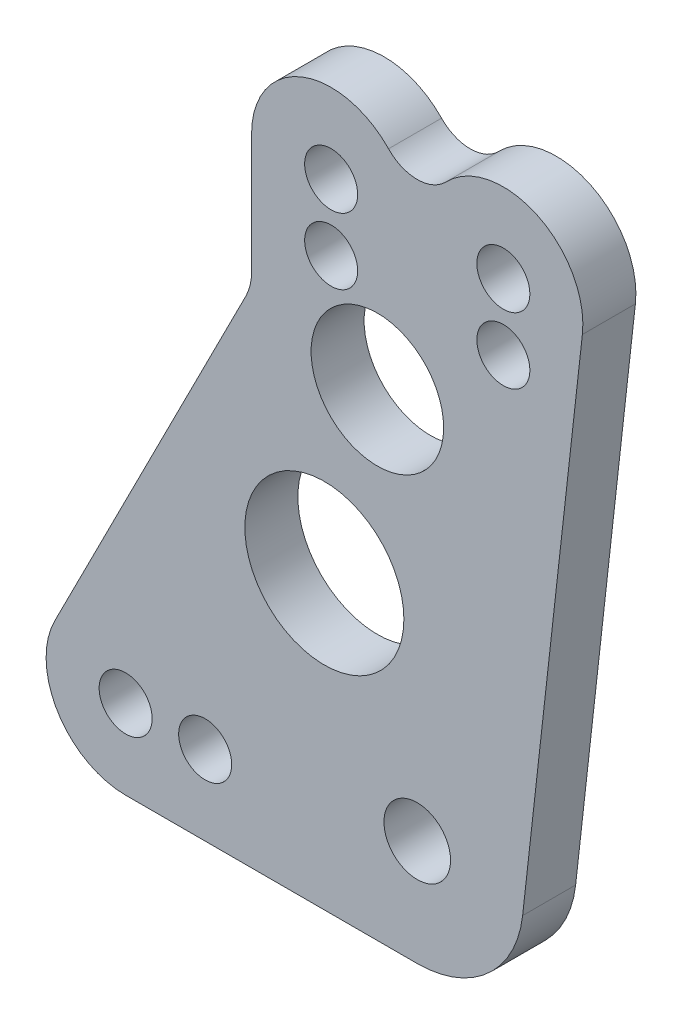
ISO-10303-21;
HEADER;
FILE_DESCRIPTION(('STEP AP214'),'2;1');
FILE_NAME('part.step','',(''),(''),'','','');
FILE_SCHEMA(('AUTOMOTIVE_DESIGN { 1 0 10303 214 1 1 1 1 }'));
ENDSEC;
DATA;
#1=APPLICATION_CONTEXT('core data for automotive mechanical design processes');
#2=APPLICATION_PROTOCOL_DEFINITION('international standard','automotive_design',2000,#1);
#3=PRODUCT_CONTEXT('',#1,'mechanical');
#4=PRODUCT('Part','Part','',(#3));
#5=PRODUCT_RELATED_PRODUCT_CATEGORY('part','',(#4));
#6=PRODUCT_DEFINITION_FORMATION('','',#4);
#7=PRODUCT_DEFINITION_CONTEXT('part definition',#1,'design');
#8=PRODUCT_DEFINITION('design','',#6,#7);
#9=PRODUCT_DEFINITION_SHAPE('','',#8);
#10=(LENGTH_UNIT() NAMED_UNIT(*) SI_UNIT(.MILLI.,.METRE.));
#11=(NAMED_UNIT(*) PLANE_ANGLE_UNIT() SI_UNIT($,.RADIAN.));
#12=(NAMED_UNIT(*) SI_UNIT($,.STERADIAN.) SOLID_ANGLE_UNIT());
#13=UNCERTAINTY_MEASURE_WITH_UNIT(LENGTH_MEASURE(1.E-05),#10,'distance_accuracy_value','');
#14=(GEOMETRIC_REPRESENTATION_CONTEXT(3) GLOBAL_UNCERTAINTY_ASSIGNED_CONTEXT((#13)) GLOBAL_UNIT_ASSIGNED_CONTEXT((#10,
#11,#12)) REPRESENTATION_CONTEXT('',''));
#15=CARTESIAN_POINT('',(0.,0.,0.));
#16=DIRECTION('',(0.,0.,1.));
#17=DIRECTION('',(1.,0.,0.));
#18=AXIS2_PLACEMENT_3D('',#15,#16,#17);
#19=CARTESIAN_POINT('',(-34.925,-3.175,6.35));
#20=DIRECTION('',(0.,0.,1.));
#21=DIRECTION('',(1.,0.,0.));
#22=AXIS2_PLACEMENT_3D('',#19,#20,#21);
#23=PLANE('',#22);
#24=CARTESIAN_POINT('',(10.3124,55.5752,6.35));
#25=DIRECTION('',(0.,0.,1.));
#26=DIRECTION('',(1.,0.,0.));
#27=AXIS2_PLACEMENT_3D('',#24,#25,#26);
#28=CIRCLE('',#27,3.175);
#29=CARTESIAN_POINT('',(7.1374,55.5752,6.35));
#30=VERTEX_POINT('',#29);
#31=EDGE_CURVE('E231',#30,#30,#28,.F.);
#32=ORIENTED_EDGE('',*,*,#31,.T.);
#33=EDGE_LOOP('',(#32));
#34=FACE_BOUND('',#33,.T.);
#35=CARTESIAN_POINT('',(-11.1252,22.225,6.35));
#36=DIRECTION('',(0.,0.,1.));
#37=DIRECTION('',(1.,0.,0.));
#38=AXIS2_PLACEMENT_3D('',#35,#36,#37);
#39=CIRCLE('',#38,9.525);
#40=CARTESIAN_POINT('',(-1.6002,22.225,6.35));
#41=VERTEX_POINT('',#40);
#42=EDGE_CURVE('E219',#41,#41,#39,.T.);
#43=ORIENTED_EDGE('',*,*,#42,.F.);
#44=EDGE_LOOP('',(#43));
#45=FACE_BOUND('',#44,.T.);
#46=CARTESIAN_POINT('',(0.,0.,6.35));
#47=DIRECTION('',(0.,0.,1.));
#48=DIRECTION('',(1.,0.,0.));
#49=AXIS2_PLACEMENT_3D('',#46,#47,#48);
#50=CIRCLE('',#49,3.9878);
#51=CARTESIAN_POINT('',(3.9878,0.,6.35));
#52=VERTEX_POINT('',#51);
#53=EDGE_CURVE('E207',#52,#52,#50,.T.);
#54=ORIENTED_EDGE('',*,*,#53,.F.);
#55=EDGE_LOOP('',(#54));
#56=FACE_BOUND('',#55,.T.);
#57=CARTESIAN_POINT('',(10.3124,63.5,6.35));
#58=DIRECTION('',(0.,0.,1.));
#59=DIRECTION('',(1.,0.,0.));
#60=AXIS2_PLACEMENT_3D('',#57,#58,#59);
#61=CIRCLE('',#60,3.175);
#62=CARTESIAN_POINT('',(13.4874,63.5,6.35));
#63=VERTEX_POINT('',#62);
#64=EDGE_CURVE('E195',#63,#63,#61,.T.);
#65=ORIENTED_EDGE('',*,*,#64,.F.);
#66=EDGE_LOOP('',(#65));
#67=FACE_BOUND('',#66,.T.);
#68=CARTESIAN_POINT('',(-34.925,-3.175,6.35));
#69=DIRECTION('',(0.,0.,1.));
#70=DIRECTION('',(1.,0.,0.));
#71=AXIS2_PLACEMENT_3D('',#68,#69,#70);
#72=CIRCLE('',#71,9.525);
#73=CARTESIAN_POINT('',(-43.4196689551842,1.13385417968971,6.35));
#74=VERTEX_POINT('',#73);
#75=CARTESIAN_POINT('',(-34.925,-12.7,6.35));
#76=VERTEX_POINT('',#75);
#77=EDGE_CURVE('E125',#74,#76,#72,.T.);
#78=ORIENTED_EDGE('',*,*,#77,.T.);
#79=DIRECTION('',(1.,0.,0.));
#80=VECTOR('',#79,1.);
#81=CARTESIAN_POINT('',(-34.925,-12.7,6.35));
#82=LINE('',#81,#80);
#83=CARTESIAN_POINT('',(0.,-12.7,6.35));
#84=VERTEX_POINT('',#83);
#85=EDGE_CURVE('E114',#76,#84,#82,.T.);
#86=ORIENTED_EDGE('',*,*,#85,.T.);
#87=CARTESIAN_POINT('',(0.,0.,6.35));
#88=DIRECTION('',(0.,0.,1.));
#89=DIRECTION('',(1.,0.,0.));
#90=AXIS2_PLACEMENT_3D('',#87,#88,#89);
#91=CIRCLE('',#90,12.7);
#92=CARTESIAN_POINT('',(12.6209658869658,-1.41464486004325,6.35));
#93=VERTEX_POINT('',#92);
#94=EDGE_CURVE('E124',#84,#93,#91,.T.);
#95=ORIENTED_EDGE('',*,*,#94,.T.);
#96=DIRECTION('',(0.111389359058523,0.993776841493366,0.));
#97=VECTOR('',#96,1.);
#98=CARTESIAN_POINT('',(12.6209658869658,-1.41464486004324,6.35));
#99=LINE('',#98,#97);
#100=CARTESIAN_POINT('',(19.7781244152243,62.4390163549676,6.35));
#101=VERTEX_POINT('',#100);
#102=EDGE_CURVE('E189',#93,#101,#99,.T.);
#103=ORIENTED_EDGE('',*,*,#102,.T.);
#104=CARTESIAN_POINT('',(10.3124,63.5,6.35));
#105=DIRECTION('',(0.,0.,1.));
#106=DIRECTION('',(1.,0.,0.));
#107=AXIS2_PLACEMENT_3D('',#104,#105,#106);
#108=CIRCLE('',#107,9.52500000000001);
#109=CARTESIAN_POINT('',(3.43746666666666,70.0924894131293,6.35));
#110=VERTEX_POINT('',#109);
#111=EDGE_CURVE('E187',#101,#110,#108,.T.);
#112=ORIENTED_EDGE('',*,*,#111,.T.);
#113=CARTESIAN_POINT('',(0.,73.388734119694,6.35));
#114=DIRECTION('',(0.,0.,-1.));
#115=DIRECTION('',(1.,0.,0.));
#116=AXIS2_PLACEMENT_3D('',#113,#114,#115);
#117=CIRCLE('',#116,4.7625);
#118=CARTESIAN_POINT('',(-3.43746666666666,70.0924894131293,6.35));
#119=VERTEX_POINT('',#118);
#120=EDGE_CURVE('E185',#110,#119,#117,.T.);
#121=ORIENTED_EDGE('',*,*,#120,.T.);
#122=CARTESIAN_POINT('',(-10.3124,63.5,6.35));
#123=DIRECTION('',(0.,0.,1.));
#124=DIRECTION('',(1.,0.,0.));
#125=AXIS2_PLACEMENT_3D('',#122,#123,#124);
#126=CIRCLE('',#125,9.525);
#127=CARTESIAN_POINT('',(-19.8374,63.5,6.35));
#128=VERTEX_POINT('',#127);
#129=EDGE_CURVE('E183',#119,#128,#126,.T.);
#130=ORIENTED_EDGE('',*,*,#129,.T.);
#131=DIRECTION('',(0.,-1.,0.));
#132=VECTOR('',#131,1.);
#133=CARTESIAN_POINT('',(-19.8374,63.5,6.35));
#134=LINE('',#133,#132);
#135=CARTESIAN_POINT('',(-19.8374,49.1434088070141,6.35));
#136=VERTEX_POINT('',#135);
#137=EDGE_CURVE('E181',#128,#136,#134,.T.);
#138=ORIENTED_EDGE('',*,*,#137,.T.);
#139=CARTESIAN_POINT('',(-26.1874,49.1434088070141,6.35));
#140=DIRECTION('',(0.,0.,1.));
#141=DIRECTION('',(1.,0.,0.));
#142=AXIS2_PLACEMENT_3D('',#139,#140,#141);
#143=CIRCLE('',#142,6.35);
#144=CARTESIAN_POINT('',(-20.5242873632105,46.2708393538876,6.35));
#145=VERTEX_POINT('',#144);
#146=EDGE_CURVE('E11',#136,#145,#143,.F.);
#147=ORIENTED_EDGE('',*,*,#146,.T.);
#148=DIRECTION('',(-0.452373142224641,-0.891828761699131,0.));
#149=VECTOR('',#148,1.);
#150=CARTESIAN_POINT('',(-19.8374,47.625,6.35));
#151=LINE('',#150,#149);
#152=EDGE_CURVE('E130',#145,#74,#151,.T.);
#153=ORIENTED_EDGE('',*,*,#152,.T.);
#154=EDGE_LOOP('',(#78,#86,#95,#103,#112,#121,#130,#138,#147,#153));
#155=FACE_BOUND('',#154,.T.);
#156=CARTESIAN_POINT('',(-25.4,-3.175,6.35));
#157=DIRECTION('',(0.,0.,1.));
#158=DIRECTION('',(1.,0.,0.));
#159=AXIS2_PLACEMENT_3D('',#156,#157,#158);
#160=CIRCLE('',#159,3.175);
#161=CARTESIAN_POINT('',(-22.225,-3.175,6.35));
#162=VERTEX_POINT('',#161);
#163=EDGE_CURVE('E179',#162,#162,#160,.T.);
#164=ORIENTED_EDGE('',*,*,#163,.F.);
#165=EDGE_LOOP('',(#164));
#166=FACE_BOUND('',#165,.T.);
#167=CARTESIAN_POINT('',(-10.3124,63.5,6.35));
#168=DIRECTION('',(0.,0.,1.));
#169=DIRECTION('',(1.,0.,0.));
#170=AXIS2_PLACEMENT_3D('',#167,#168,#169);
#171=CIRCLE('',#170,3.175);
#172=CARTESIAN_POINT('',(-7.1374,63.5,6.35));
#173=VERTEX_POINT('',#172);
#174=EDGE_CURVE('E201',#173,#173,#171,.T.);
#175=ORIENTED_EDGE('',*,*,#174,.F.);
#176=EDGE_LOOP('',(#175));
#177=FACE_BOUND('',#176,.T.);
#178=CARTESIAN_POINT('',(-34.925,-3.175,6.35));
#179=DIRECTION('',(0.,0.,1.));
#180=DIRECTION('',(1.,0.,0.));
#181=AXIS2_PLACEMENT_3D('',#178,#179,#180);
#182=CIRCLE('',#181,3.17500000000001);
#183=CARTESIAN_POINT('',(-31.75,-3.175,6.35));
#184=VERTEX_POINT('',#183);
#185=EDGE_CURVE('E213',#184,#184,#182,.T.);
#186=ORIENTED_EDGE('',*,*,#185,.F.);
#187=EDGE_LOOP('',(#186));
#188=FACE_BOUND('',#187,.T.);
#189=CARTESIAN_POINT('',(-4.7752,44.45,6.35));
#190=DIRECTION('',(0.,0.,1.));
#191=DIRECTION('',(1.,0.,0.));
#192=AXIS2_PLACEMENT_3D('',#189,#190,#191);
#193=CIRCLE('',#192,7.9375);
#194=CARTESIAN_POINT('',(3.1623,44.45,6.35));
#195=VERTEX_POINT('',#194);
#196=EDGE_CURVE('E225',#195,#195,#193,.T.);
#197=ORIENTED_EDGE('',*,*,#196,.F.);
#198=EDGE_LOOP('',(#197));
#199=FACE_BOUND('',#198,.T.);
#200=CARTESIAN_POINT('',(-10.3124,55.5752,6.35));
#201=DIRECTION('',(0.,0.,1.));
#202=DIRECTION('',(1.,0.,0.));
#203=AXIS2_PLACEMENT_3D('',#200,#201,#202);
#204=CIRCLE('',#203,3.175);
#205=CARTESIAN_POINT('',(-13.4874,55.5752,6.35));
#206=VERTEX_POINT('',#205);
#207=EDGE_CURVE('E239',#206,#206,#204,.F.);
#208=ORIENTED_EDGE('',*,*,#207,.T.);
#209=EDGE_LOOP('',(#208));
#210=FACE_BOUND('',#209,.T.);
#211=ADVANCED_FACE('F37',(#34,#45,#56,#67,#155,#166,#177,#188,#199,#210),#23,.T.);
#212=CARTESIAN_POINT('',(-34.925,-3.175,0.));
#213=DIRECTION('',(0.,0.,1.));
#214=DIRECTION('',(1.,0.,0.));
#215=AXIS2_PLACEMENT_3D('',#212,#213,#214);
#216=PLANE('',#215);
#217=CARTESIAN_POINT('',(10.3124,55.5752,0.));
#218=DIRECTION('',(0.,0.,1.));
#219=DIRECTION('',(1.,0.,0.));
#220=AXIS2_PLACEMENT_3D('',#217,#218,#219);
#221=CIRCLE('',#220,3.175);
#222=CARTESIAN_POINT('',(7.1374,55.5752,0.));
#223=VERTEX_POINT('',#222);
#224=EDGE_CURVE('E236',#223,#223,#221,.T.);
#225=ORIENTED_EDGE('',*,*,#224,.T.);
#226=EDGE_LOOP('',(#225));
#227=FACE_BOUND('',#226,.T.);
#228=CARTESIAN_POINT('',(-11.1252,22.225,0.));
#229=DIRECTION('',(0.,0.,1.));
#230=DIRECTION('',(1.,0.,0.));
#231=AXIS2_PLACEMENT_3D('',#228,#229,#230);
#232=CIRCLE('',#231,9.525);
#233=CARTESIAN_POINT('',(-1.6002,22.225,0.));
#234=VERTEX_POINT('',#233);
#235=EDGE_CURVE('E222',#234,#234,#232,.T.);
#236=ORIENTED_EDGE('',*,*,#235,.T.);
#237=EDGE_LOOP('',(#236));
#238=FACE_BOUND('',#237,.T.);
#239=CARTESIAN_POINT('',(0.,0.,0.));
#240=DIRECTION('',(0.,0.,1.));
#241=DIRECTION('',(1.,0.,0.));
#242=AXIS2_PLACEMENT_3D('',#239,#240,#241);
#243=CIRCLE('',#242,3.9878);
#244=CARTESIAN_POINT('',(3.9878,0.,0.));
#245=VERTEX_POINT('',#244);
#246=EDGE_CURVE('E210',#245,#245,#243,.T.);
#247=ORIENTED_EDGE('',*,*,#246,.T.);
#248=EDGE_LOOP('',(#247));
#249=FACE_BOUND('',#248,.T.);
#250=CARTESIAN_POINT('',(10.3124,63.5,0.));
#251=DIRECTION('',(0.,0.,1.));
#252=DIRECTION('',(1.,0.,0.));
#253=AXIS2_PLACEMENT_3D('',#250,#251,#252);
#254=CIRCLE('',#253,3.175);
#255=CARTESIAN_POINT('',(13.4874,63.5,0.));
#256=VERTEX_POINT('',#255);
#257=EDGE_CURVE('E198',#256,#256,#254,.T.);
#258=ORIENTED_EDGE('',*,*,#257,.T.);
#259=EDGE_LOOP('',(#258));
#260=FACE_BOUND('',#259,.T.);
#261=CARTESIAN_POINT('',(-34.925,-3.175,0.));
#262=DIRECTION('',(0.,0.,1.));
#263=DIRECTION('',(1.,0.,0.));
#264=AXIS2_PLACEMENT_3D('',#261,#262,#263);
#265=CIRCLE('',#264,9.525);
#266=CARTESIAN_POINT('',(-43.4196689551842,1.13385417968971,0.));
#267=VERTEX_POINT('',#266);
#268=CARTESIAN_POINT('',(-34.925,-12.7,0.));
#269=VERTEX_POINT('',#268);
#270=EDGE_CURVE('E138',#267,#269,#265,.T.);
#271=ORIENTED_EDGE('',*,*,#270,.F.);
#272=DIRECTION('',(-0.452373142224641,-0.891828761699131,0.));
#273=VECTOR('',#272,1.);
#274=CARTESIAN_POINT('',(-19.8374,47.625,0.));
#275=LINE('',#274,#273);
#276=CARTESIAN_POINT('',(-20.5242873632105,46.2708393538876,0.));
#277=VERTEX_POINT('',#276);
#278=EDGE_CURVE('E134',#277,#267,#275,.T.);
#279=ORIENTED_EDGE('',*,*,#278,.F.);
#280=CARTESIAN_POINT('',(-26.1874,49.1434088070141,0.));
#281=DIRECTION('',(0.,0.,1.));
#282=DIRECTION('',(1.,0.,0.));
#283=AXIS2_PLACEMENT_3D('',#280,#281,#282);
#284=CIRCLE('',#283,6.35);
#285=CARTESIAN_POINT('',(-19.8374,49.1434088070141,0.));
#286=VERTEX_POINT('',#285);
#287=EDGE_CURVE('E45',#277,#286,#284,.T.);
#288=ORIENTED_EDGE('',*,*,#287,.T.);
#289=DIRECTION('',(0.,-1.,0.));
#290=VECTOR('',#289,1.);
#291=CARTESIAN_POINT('',(-19.8374,63.5,0.));
#292=LINE('',#291,#290);
#293=CARTESIAN_POINT('',(-19.8374,63.5,0.));
#294=VERTEX_POINT('',#293);
#295=EDGE_CURVE('E164',#294,#286,#292,.T.);
#296=ORIENTED_EDGE('',*,*,#295,.F.);
#297=CARTESIAN_POINT('',(-10.3124,63.5,0.));
#298=DIRECTION('',(0.,0.,1.));
#299=DIRECTION('',(1.,0.,0.));
#300=AXIS2_PLACEMENT_3D('',#297,#298,#299);
#301=CIRCLE('',#300,9.525);
#302=CARTESIAN_POINT('',(-3.43746666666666,70.0924894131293,0.));
#303=VERTEX_POINT('',#302);
#304=EDGE_CURVE('E166',#303,#294,#301,.T.);
#305=ORIENTED_EDGE('',*,*,#304,.F.);
#306=CARTESIAN_POINT('',(0.,73.388734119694,0.));
#307=DIRECTION('',(0.,0.,-1.));
#308=DIRECTION('',(1.,0.,0.));
#309=AXIS2_PLACEMENT_3D('',#306,#307,#308);
#310=CIRCLE('',#309,4.7625);
#311=CARTESIAN_POINT('',(3.43746666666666,70.0924894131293,0.));
#312=VERTEX_POINT('',#311);
#313=EDGE_CURVE('E168',#312,#303,#310,.T.);
#314=ORIENTED_EDGE('',*,*,#313,.F.);
#315=CARTESIAN_POINT('',(10.3124,63.5,0.));
#316=DIRECTION('',(0.,0.,1.));
#317=DIRECTION('',(1.,0.,0.));
#318=AXIS2_PLACEMENT_3D('',#315,#316,#317);
#319=CIRCLE('',#318,9.52500000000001);
#320=CARTESIAN_POINT('',(19.7781244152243,62.4390163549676,0.));
#321=VERTEX_POINT('',#320);
#322=EDGE_CURVE('E170',#321,#312,#319,.T.);
#323=ORIENTED_EDGE('',*,*,#322,.F.);
#324=DIRECTION('',(0.111389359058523,0.993776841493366,0.));
#325=VECTOR('',#324,1.);
#326=CARTESIAN_POINT('',(12.6209658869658,-1.41464486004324,0.));
#327=LINE('',#326,#325);
#328=CARTESIAN_POINT('',(12.6209658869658,-1.41464486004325,0.));
#329=VERTEX_POINT('',#328);
#330=EDGE_CURVE('E172',#329,#321,#327,.T.);
#331=ORIENTED_EDGE('',*,*,#330,.F.);
#332=CARTESIAN_POINT('',(0.,0.,0.));
#333=DIRECTION('',(0.,0.,1.));
#334=DIRECTION('',(1.,0.,0.));
#335=AXIS2_PLACEMENT_3D('',#332,#333,#334);
#336=CIRCLE('',#335,12.7);
#337=CARTESIAN_POINT('',(0.,-12.7,0.));
#338=VERTEX_POINT('',#337);
#339=EDGE_CURVE('E174',#338,#329,#336,.T.);
#340=ORIENTED_EDGE('',*,*,#339,.F.);
#341=DIRECTION('',(1.,0.,0.));
#342=VECTOR('',#341,1.);
#343=CARTESIAN_POINT('',(-34.925,-12.7,0.));
#344=LINE('',#343,#342);
#345=EDGE_CURVE('E176',#269,#338,#344,.T.);
#346=ORIENTED_EDGE('',*,*,#345,.F.);
#347=EDGE_LOOP('',(#271,#279,#288,#296,#305,#314,#323,#331,#340,#346));
#348=FACE_BOUND('',#347,.T.);
#349=CARTESIAN_POINT('',(-25.4,-3.175,0.));
#350=DIRECTION('',(0.,0.,1.));
#351=DIRECTION('',(1.,0.,0.));
#352=AXIS2_PLACEMENT_3D('',#349,#350,#351);
#353=CIRCLE('',#352,3.175);
#354=CARTESIAN_POINT('',(-22.225,-3.175,0.));
#355=VERTEX_POINT('',#354);
#356=EDGE_CURVE('E192',#355,#355,#353,.T.);
#357=ORIENTED_EDGE('',*,*,#356,.T.);
#358=EDGE_LOOP('',(#357));
#359=FACE_BOUND('',#358,.T.);
#360=CARTESIAN_POINT('',(-10.3124,63.5,0.));
#361=DIRECTION('',(0.,0.,1.));
#362=DIRECTION('',(1.,0.,0.));
#363=AXIS2_PLACEMENT_3D('',#360,#361,#362);
#364=CIRCLE('',#363,3.175);
#365=CARTESIAN_POINT('',(-7.1374,63.5,0.));
#366=VERTEX_POINT('',#365);
#367=EDGE_CURVE('E204',#366,#366,#364,.T.);
#368=ORIENTED_EDGE('',*,*,#367,.T.);
#369=EDGE_LOOP('',(#368));
#370=FACE_BOUND('',#369,.T.);
#371=CARTESIAN_POINT('',(-34.925,-3.175,0.));
#372=DIRECTION('',(0.,0.,1.));
#373=DIRECTION('',(1.,0.,0.));
#374=AXIS2_PLACEMENT_3D('',#371,#372,#373);
#375=CIRCLE('',#374,3.17500000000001);
#376=CARTESIAN_POINT('',(-31.75,-3.175,0.));
#377=VERTEX_POINT('',#376);
#378=EDGE_CURVE('E216',#377,#377,#375,.T.);
#379=ORIENTED_EDGE('',*,*,#378,.T.);
#380=EDGE_LOOP('',(#379));
#381=FACE_BOUND('',#380,.T.);
#382=CARTESIAN_POINT('',(-4.7752,44.45,0.));
#383=DIRECTION('',(0.,0.,1.));
#384=DIRECTION('',(1.,0.,0.));
#385=AXIS2_PLACEMENT_3D('',#382,#383,#384);
#386=CIRCLE('',#385,7.9375);
#387=CARTESIAN_POINT('',(3.1623,44.45,0.));
#388=VERTEX_POINT('',#387);
#389=EDGE_CURVE('E228',#388,#388,#386,.T.);
#390=ORIENTED_EDGE('',*,*,#389,.T.);
#391=EDGE_LOOP('',(#390));
#392=FACE_BOUND('',#391,.T.);
#393=CARTESIAN_POINT('',(-10.3124,55.5752,0.));
#394=DIRECTION('',(0.,0.,1.));
#395=DIRECTION('',(1.,0.,0.));
#396=AXIS2_PLACEMENT_3D('',#393,#394,#395);
#397=CIRCLE('',#396,3.175);
#398=CARTESIAN_POINT('',(-13.4874,55.5752,0.));
#399=VERTEX_POINT('',#398);
#400=EDGE_CURVE('E242',#399,#399,#397,.T.);
#401=ORIENTED_EDGE('',*,*,#400,.T.);
#402=EDGE_LOOP('',(#401));
#403=FACE_BOUND('',#402,.T.);
#404=ADVANCED_FACE('F246',(#227,#238,#249,#260,#348,#359,#370,#381,#392,#403),#216,.F.);
#405=CARTESIAN_POINT('',(-34.925,-3.175,6.35));
#406=DIRECTION('',(0.,0.,-1.));
#407=DIRECTION('',(-1.,0.,0.));
#408=AXIS2_PLACEMENT_3D('',#405,#406,#407);
#409=CYLINDRICAL_SURFACE('',#408,9.525);
#410=ORIENTED_EDGE('',*,*,#270,.T.);
#411=DIRECTION('',(0.,0.,-1.));
#412=VECTOR('',#411,1.);
#413=CARTESIAN_POINT('',(-34.925,-12.7,6.35));
#414=LINE('',#413,#412);
#415=EDGE_CURVE('E118',#76,#269,#414,.T.);
#416=ORIENTED_EDGE('',*,*,#415,.F.);
#417=ORIENTED_EDGE('',*,*,#77,.F.);
#418=DIRECTION('',(0.,0.,-1.));
#419=VECTOR('',#418,1.);
#420=CARTESIAN_POINT('',(-43.4196689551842,1.13385417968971,6.35));
#421=LINE('',#420,#419);
#422=EDGE_CURVE('E161',#74,#267,#421,.T.);
#423=ORIENTED_EDGE('',*,*,#422,.T.);
#424=EDGE_LOOP('',(#410,#416,#417,#423));
#425=FACE_BOUND('',#424,.T.);
#426=ADVANCED_FACE('F136',(#425),#409,.T.);
#427=CARTESIAN_POINT('',(-34.925,-12.7,6.35));
#428=DIRECTION('',(0.,1.,0.));
#429=DIRECTION('',(-1.,0.,0.));
#430=AXIS2_PLACEMENT_3D('',#427,#428,#429);
#431=PLANE('',#430);
#432=ORIENTED_EDGE('',*,*,#345,.T.);
#433=DIRECTION('',(0.,0.,-1.));
#434=VECTOR('',#433,1.);
#435=CARTESIAN_POINT('',(0.,-12.7,6.35));
#436=LINE('',#435,#434);
#437=EDGE_CURVE('E121',#84,#338,#436,.T.);
#438=ORIENTED_EDGE('',*,*,#437,.F.);
#439=ORIENTED_EDGE('',*,*,#85,.F.);
#440=ORIENTED_EDGE('',*,*,#415,.T.);
#441=EDGE_LOOP('',(#432,#438,#439,#440));
#442=FACE_BOUND('',#441,.T.);
#443=ADVANCED_FACE('F116',(#442),#431,.F.);
#444=CARTESIAN_POINT('',(0.,0.,6.35));
#445=DIRECTION('',(0.,0.,-1.));
#446=DIRECTION('',(-1.,0.,0.));
#447=AXIS2_PLACEMENT_3D('',#444,#445,#446);
#448=CYLINDRICAL_SURFACE('',#447,12.7);
#449=ORIENTED_EDGE('',*,*,#339,.T.);
#450=DIRECTION('',(0.,0.,-1.));
#451=VECTOR('',#450,1.);
#452=CARTESIAN_POINT('',(12.6209658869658,-1.41464486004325,6.35));
#453=LINE('',#452,#451);
#454=EDGE_CURVE('E143',#93,#329,#453,.T.);
#455=ORIENTED_EDGE('',*,*,#454,.F.);
#456=ORIENTED_EDGE('',*,*,#94,.F.);
#457=ORIENTED_EDGE('',*,*,#437,.T.);
#458=EDGE_LOOP('',(#449,#455,#456,#457));
#459=FACE_BOUND('',#458,.T.);
#460=ADVANCED_FACE('F297',(#459),#448,.T.);
#461=CARTESIAN_POINT('',(12.6209658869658,-1.41464486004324,6.35));
#462=DIRECTION('',(-0.993776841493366,0.111389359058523,0.));
#463=DIRECTION('',(-0.111389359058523,-0.993776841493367,0.));
#464=AXIS2_PLACEMENT_3D('',#461,#462,#463);
#465=PLANE('',#464);
#466=ORIENTED_EDGE('',*,*,#330,.T.);
#467=DIRECTION('',(0.,0.,-1.));
#468=VECTOR('',#467,1.);
#469=CARTESIAN_POINT('',(19.7781244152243,62.4390163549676,6.35));
#470=LINE('',#469,#468);
#471=EDGE_CURVE('E149',#101,#321,#470,.T.);
#472=ORIENTED_EDGE('',*,*,#471,.F.);
#473=ORIENTED_EDGE('',*,*,#102,.F.);
#474=ORIENTED_EDGE('',*,*,#454,.T.);
#475=EDGE_LOOP('',(#466,#472,#473,#474));
#476=FACE_BOUND('',#475,.T.);
#477=ADVANCED_FACE('F293',(#476),#465,.F.);
#478=CARTESIAN_POINT('',(10.3124,63.5,6.35));
#479=DIRECTION('',(0.,0.,-1.));
#480=DIRECTION('',(-1.,0.,0.));
#481=AXIS2_PLACEMENT_3D('',#478,#479,#480);
#482=CYLINDRICAL_SURFACE('',#481,9.52500000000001);
#483=ORIENTED_EDGE('',*,*,#322,.T.);
#484=DIRECTION('',(0.,0.,-1.));
#485=VECTOR('',#484,1.);
#486=CARTESIAN_POINT('',(3.43746666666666,70.0924894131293,6.35));
#487=LINE('',#486,#485);
#488=EDGE_CURVE('E152',#110,#312,#487,.T.);
#489=ORIENTED_EDGE('',*,*,#488,.F.);
#490=ORIENTED_EDGE('',*,*,#111,.F.);
#491=ORIENTED_EDGE('',*,*,#471,.T.);
#492=EDGE_LOOP('',(#483,#489,#490,#491));
#493=FACE_BOUND('',#492,.T.);
#494=ADVANCED_FACE('F289',(#493),#482,.T.);
#495=CARTESIAN_POINT('',(0.,73.388734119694,6.35));
#496=DIRECTION('',(0.,0.,-1.));
#497=DIRECTION('',(-1.,0.,0.));
#498=AXIS2_PLACEMENT_3D('',#495,#496,#497);
#499=CYLINDRICAL_SURFACE('',#498,4.7625);
#500=ORIENTED_EDGE('',*,*,#313,.T.);
#501=DIRECTION('',(0.,0.,-1.));
#502=VECTOR('',#501,1.);
#503=CARTESIAN_POINT('',(-3.43746666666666,70.0924894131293,6.35));
#504=LINE('',#503,#502);
#505=EDGE_CURVE('E155',#119,#303,#504,.T.);
#506=ORIENTED_EDGE('',*,*,#505,.F.);
#507=ORIENTED_EDGE('',*,*,#120,.F.);
#508=ORIENTED_EDGE('',*,*,#488,.T.);
#509=EDGE_LOOP('',(#500,#506,#507,#508));
#510=FACE_BOUND('',#509,.T.);
#511=ADVANCED_FACE('F285',(#510),#499,.F.);
#512=CARTESIAN_POINT('',(-10.3124,63.5,6.35));
#513=DIRECTION('',(0.,0.,-1.));
#514=DIRECTION('',(-1.,0.,0.));
#515=AXIS2_PLACEMENT_3D('',#512,#513,#514);
#516=CYLINDRICAL_SURFACE('',#515,9.525);
#517=ORIENTED_EDGE('',*,*,#304,.T.);
#518=DIRECTION('',(0.,0.,-1.));
#519=VECTOR('',#518,1.);
#520=CARTESIAN_POINT('',(-19.8374,63.5,6.35));
#521=LINE('',#520,#519);
#522=EDGE_CURVE('E158',#128,#294,#521,.T.);
#523=ORIENTED_EDGE('',*,*,#522,.F.);
#524=ORIENTED_EDGE('',*,*,#129,.F.);
#525=ORIENTED_EDGE('',*,*,#505,.T.);
#526=EDGE_LOOP('',(#517,#523,#524,#525));
#527=FACE_BOUND('',#526,.T.);
#528=ADVANCED_FACE('F282',(#527),#516,.T.);
#529=CARTESIAN_POINT('',(-19.8374,63.5,6.35));
#530=DIRECTION('',(1.,0.,0.));
#531=DIRECTION('',(0.,0.,-1.));
#532=AXIS2_PLACEMENT_3D('',#529,#530,#531);
#533=PLANE('',#532);
#534=ORIENTED_EDGE('',*,*,#295,.T.);
#535=DIRECTION('',(0.,0.,-1.));
#536=VECTOR('',#535,1.);
#537=CARTESIAN_POINT('',(-19.8374,49.1434088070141,6.35));
#538=LINE('',#537,#536);
#539=EDGE_CURVE('E52',#286,#136,#538,.F.);
#540=ORIENTED_EDGE('',*,*,#539,.T.);
#541=ORIENTED_EDGE('',*,*,#137,.F.);
#542=ORIENTED_EDGE('',*,*,#522,.T.);
#543=EDGE_LOOP('',(#534,#540,#541,#542));
#544=FACE_BOUND('',#543,.T.);
#545=ADVANCED_FACE('F278',(#544),#533,.F.);
#546=CARTESIAN_POINT('',(-19.8374,47.625,6.35));
#547=DIRECTION('',(0.89182876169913,-0.452373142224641,0.));
#548=DIRECTION('',(0.452373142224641,0.891828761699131,0.));
#549=AXIS2_PLACEMENT_3D('',#546,#547,#548);
#550=PLANE('',#549);
#551=ORIENTED_EDGE('',*,*,#152,.F.);
#552=DIRECTION('',(0.,0.,-1.));
#553=VECTOR('',#552,1.);
#554=CARTESIAN_POINT('',(-20.5242873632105,46.2708393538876,0.));
#555=LINE('',#554,#553);
#556=EDGE_CURVE('E139',#145,#277,#555,.T.);
#557=ORIENTED_EDGE('',*,*,#556,.T.);
#558=ORIENTED_EDGE('',*,*,#278,.T.);
#559=ORIENTED_EDGE('',*,*,#422,.F.);
#560=EDGE_LOOP('',(#551,#557,#558,#559));
#561=FACE_BOUND('',#560,.T.);
#562=ADVANCED_FACE('F275',(#561),#550,.F.);
#563=CARTESIAN_POINT('',(-25.4,-3.175,6.35));
#564=DIRECTION('',(0.,0.,-1.));
#565=DIRECTION('',(-1.,0.,0.));
#566=AXIS2_PLACEMENT_3D('',#563,#564,#565);
#567=CYLINDRICAL_SURFACE('',#566,3.175);
#568=ORIENTED_EDGE('',*,*,#163,.T.);
#569=EDGE_LOOP('',(#568));
#570=FACE_BOUND('',#569,.T.);
#571=ORIENTED_EDGE('',*,*,#356,.F.);
#572=EDGE_LOOP('',(#571));
#573=FACE_BOUND('',#572,.T.);
#574=ADVANCED_FACE('F272',(#570,#573),#567,.F.);
#575=CARTESIAN_POINT('',(10.3124,63.5,6.35));
#576=DIRECTION('',(0.,0.,-1.));
#577=DIRECTION('',(-1.,0.,0.));
#578=AXIS2_PLACEMENT_3D('',#575,#576,#577);
#579=CYLINDRICAL_SURFACE('',#578,3.175);
#580=ORIENTED_EDGE('',*,*,#64,.T.);
#581=EDGE_LOOP('',(#580));
#582=FACE_BOUND('',#581,.T.);
#583=ORIENTED_EDGE('',*,*,#257,.F.);
#584=EDGE_LOOP('',(#583));
#585=FACE_BOUND('',#584,.T.);
#586=ADVANCED_FACE('F347',(#582,#585),#579,.F.);
#587=CARTESIAN_POINT('',(-10.3124,63.5,6.35));
#588=DIRECTION('',(0.,0.,-1.));
#589=DIRECTION('',(-1.,0.,0.));
#590=AXIS2_PLACEMENT_3D('',#587,#588,#589);
#591=CYLINDRICAL_SURFACE('',#590,3.175);
#592=ORIENTED_EDGE('',*,*,#174,.T.);
#593=EDGE_LOOP('',(#592));
#594=FACE_BOUND('',#593,.T.);
#595=ORIENTED_EDGE('',*,*,#367,.F.);
#596=EDGE_LOOP('',(#595));
#597=FACE_BOUND('',#596,.T.);
#598=ADVANCED_FACE('F354',(#594,#597),#591,.F.);
#599=CARTESIAN_POINT('',(0.,0.,6.35));
#600=DIRECTION('',(0.,0.,-1.));
#601=DIRECTION('',(-1.,0.,0.));
#602=AXIS2_PLACEMENT_3D('',#599,#600,#601);
#603=CYLINDRICAL_SURFACE('',#602,3.9878);
#604=ORIENTED_EDGE('',*,*,#53,.T.);
#605=EDGE_LOOP('',(#604));
#606=FACE_BOUND('',#605,.T.);
#607=ORIENTED_EDGE('',*,*,#246,.F.);
#608=EDGE_LOOP('',(#607));
#609=FACE_BOUND('',#608,.T.);
#610=ADVANCED_FACE('F361',(#606,#609),#603,.F.);
#611=CARTESIAN_POINT('',(-34.925,-3.175,6.35));
#612=DIRECTION('',(0.,0.,-1.));
#613=DIRECTION('',(-1.,0.,0.));
#614=AXIS2_PLACEMENT_3D('',#611,#612,#613);
#615=CYLINDRICAL_SURFACE('',#614,3.17500000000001);
#616=ORIENTED_EDGE('',*,*,#185,.T.);
#617=EDGE_LOOP('',(#616));
#618=FACE_BOUND('',#617,.T.);
#619=ORIENTED_EDGE('',*,*,#378,.F.);
#620=EDGE_LOOP('',(#619));
#621=FACE_BOUND('',#620,.T.);
#622=ADVANCED_FACE('F369',(#618,#621),#615,.F.);
#623=CARTESIAN_POINT('',(-11.1252,22.225,6.35));
#624=DIRECTION('',(0.,0.,-1.));
#625=DIRECTION('',(-1.,0.,0.));
#626=AXIS2_PLACEMENT_3D('',#623,#624,#625);
#627=CYLINDRICAL_SURFACE('',#626,9.525);
#628=ORIENTED_EDGE('',*,*,#42,.T.);
#629=EDGE_LOOP('',(#628));
#630=FACE_BOUND('',#629,.T.);
#631=ORIENTED_EDGE('',*,*,#235,.F.);
#632=EDGE_LOOP('',(#631));
#633=FACE_BOUND('',#632,.T.);
#634=ADVANCED_FACE('F377',(#630,#633),#627,.F.);
#635=CARTESIAN_POINT('',(-4.7752,44.45,6.35));
#636=DIRECTION('',(0.,0.,-1.));
#637=DIRECTION('',(-1.,0.,0.));
#638=AXIS2_PLACEMENT_3D('',#635,#636,#637);
#639=CYLINDRICAL_SURFACE('',#638,7.9375);
#640=ORIENTED_EDGE('',*,*,#196,.T.);
#641=EDGE_LOOP('',(#640));
#642=FACE_BOUND('',#641,.T.);
#643=ORIENTED_EDGE('',*,*,#389,.F.);
#644=EDGE_LOOP('',(#643));
#645=FACE_BOUND('',#644,.T.);
#646=ADVANCED_FACE('F258',(#642,#645),#639,.F.);
#647=CARTESIAN_POINT('',(10.3124,55.5752,7.62));
#648=DIRECTION('',(0.,0.,-1.));
#649=DIRECTION('',(-1.,0.,0.));
#650=AXIS2_PLACEMENT_3D('',#647,#648,#649);
#651=CYLINDRICAL_SURFACE('',#650,3.175);
#652=CARTESIAN_POINT('',(7.1374,55.5752,6.35));
#653=CARTESIAN_POINT('',(7.1374,55.5752,6.28385416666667));
#654=CARTESIAN_POINT('',(7.1374,55.5752,6.21770833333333));
#655=CARTESIAN_POINT('',(7.1374,55.5752,6.08541666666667));
#656=CARTESIAN_POINT('',(7.1374,55.5752,6.01927083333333));
#657=CARTESIAN_POINT('',(7.1374,55.5752,5.88697916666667));
#658=CARTESIAN_POINT('',(7.1374,55.5752,5.82083333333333));
#659=CARTESIAN_POINT('',(7.1374,55.5752,5.68854166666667));
#660=CARTESIAN_POINT('',(7.1374,55.5752,5.62239583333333));
#661=CARTESIAN_POINT('',(7.1374,55.5752,5.49010416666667));
#662=CARTESIAN_POINT('',(7.1374,55.5752,5.42395833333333));
#663=CARTESIAN_POINT('',(7.1374,55.5752,5.29166666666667));
#664=CARTESIAN_POINT('',(7.1374,55.5752,5.22552083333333));
#665=CARTESIAN_POINT('',(7.1374,55.5752,5.09322916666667));
#666=CARTESIAN_POINT('',(7.1374,55.5752,5.02708333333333));
#667=CARTESIAN_POINT('',(7.1374,55.5752,4.89479166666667));
#668=CARTESIAN_POINT('',(7.1374,55.5752,4.82864583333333));
#669=CARTESIAN_POINT('',(7.1374,55.5752,4.69635416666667));
#670=CARTESIAN_POINT('',(7.1374,55.5752,4.63020833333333));
#671=CARTESIAN_POINT('',(7.1374,55.5752,4.49791666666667));
#672=CARTESIAN_POINT('',(7.1374,55.5752,4.43177083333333));
#673=CARTESIAN_POINT('',(7.1374,55.5752,4.29947916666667));
#674=CARTESIAN_POINT('',(7.1374,55.5752,4.23333333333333));
#675=CARTESIAN_POINT('',(7.1374,55.5752,4.10104166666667));
#676=CARTESIAN_POINT('',(7.1374,55.5752,4.03489583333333));
#677=CARTESIAN_POINT('',(7.1374,55.5752,3.90260416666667));
#678=CARTESIAN_POINT('',(7.1374,55.5752,3.83645833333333));
#679=CARTESIAN_POINT('',(7.1374,55.5752,3.70416666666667));
#680=CARTESIAN_POINT('',(7.1374,55.5752,3.63802083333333));
#681=CARTESIAN_POINT('',(7.1374,55.5752,3.50572916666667));
#682=CARTESIAN_POINT('',(7.1374,55.5752,3.43958333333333));
#683=CARTESIAN_POINT('',(7.1374,55.5752,3.30729166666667));
#684=CARTESIAN_POINT('',(7.1374,55.5752,3.24114583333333));
#685=CARTESIAN_POINT('',(7.1374,55.5752,3.10885416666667));
#686=CARTESIAN_POINT('',(7.1374,55.5752,3.04270833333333));
#687=CARTESIAN_POINT('',(7.1374,55.5752,2.91041666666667));
#688=CARTESIAN_POINT('',(7.1374,55.5752,2.84427083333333));
#689=CARTESIAN_POINT('',(7.1374,55.5752,2.71197916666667));
#690=CARTESIAN_POINT('',(7.1374,55.5752,2.64583333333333));
#691=CARTESIAN_POINT('',(7.1374,55.5752,2.51354166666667));
#692=CARTESIAN_POINT('',(7.1374,55.5752,2.44739583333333));
#693=CARTESIAN_POINT('',(7.1374,55.5752,2.31510416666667));
#694=CARTESIAN_POINT('',(7.1374,55.5752,2.24895833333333));
#695=CARTESIAN_POINT('',(7.1374,55.5752,2.11666666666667));
#696=CARTESIAN_POINT('',(7.1374,55.5752,2.05052083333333));
#697=CARTESIAN_POINT('',(7.1374,55.5752,1.91822916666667));
#698=CARTESIAN_POINT('',(7.1374,55.5752,1.85208333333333));
#699=CARTESIAN_POINT('',(7.1374,55.5752,1.71979166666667));
#700=CARTESIAN_POINT('',(7.1374,55.5752,1.65364583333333));
#701=CARTESIAN_POINT('',(7.1374,55.5752,1.52135416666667));
#702=CARTESIAN_POINT('',(7.1374,55.5752,1.45520833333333));
#703=CARTESIAN_POINT('',(7.1374,55.5752,1.32291666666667));
#704=CARTESIAN_POINT('',(7.1374,55.5752,1.25677083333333));
#705=CARTESIAN_POINT('',(7.1374,55.5752,1.12447916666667));
#706=CARTESIAN_POINT('',(7.1374,55.5752,1.05833333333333));
#707=CARTESIAN_POINT('',(7.1374,55.5752,0.926041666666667));
#708=CARTESIAN_POINT('',(7.1374,55.5752,0.859895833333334));
#709=CARTESIAN_POINT('',(7.1374,55.5752,0.727604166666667));
#710=CARTESIAN_POINT('',(7.1374,55.5752,0.661458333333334));
#711=CARTESIAN_POINT('',(7.1374,55.5752,0.529166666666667));
#712=CARTESIAN_POINT('',(7.1374,55.5752,0.463020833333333));
#713=CARTESIAN_POINT('',(7.1374,55.5752,0.330729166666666));
#714=CARTESIAN_POINT('',(7.1374,55.5752,0.264583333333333));
#715=CARTESIAN_POINT('',(7.1374,55.5752,0.132291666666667));
#716=CARTESIAN_POINT('',(7.1374,55.5752,0.0661458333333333));
#717=CARTESIAN_POINT('',(7.1374,55.5752,0.));
#718=B_SPLINE_CURVE_WITH_KNOTS('',3,(#652,#653,#654,#655,#656,#657,#658,#659,#660,#661,#662,
#663,#664,#665,#666,#667,#668,#669,#670,#671,#672,#673,#674,#675,#676,#677,#678,#679,#680,#681,
#682,#683,#684,#685,#686,#687,#688,#689,#690,#691,#692,#693,#694,#695,#696,#697,#698,#699,#700,
#701,#702,#703,#704,#705,#706,#707,#708,#709,#710,#711,#712,#713,#714,#715,#716,#717),
.UNSPECIFIED.,.F.,.F.,(4,2,2,2,2,2,2,2,2,2,2,2,2,2,2,2,2,2,2,2,2,2,2,2,2,2,2,2,2,2,2,2,4),(0.,
0.1984375,0.396875,0.595312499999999,0.79375,0.992187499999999,1.190625,1.3890625,1.5875,
1.7859375,1.984375,2.1828125,2.38125,2.5796875,2.778125,2.9765625,3.175,3.3734375,3.571875,
3.7703125,3.96875,4.1671875,4.365625,4.5640625,4.7625,4.9609375,5.159375,5.3578125,5.55625,
5.7546875,5.953125,6.1515625,6.35),.UNSPECIFIED.);
#719=EDGE_CURVE('BSEAM250',#30,#223,#718,.T.);
#720=ORIENTED_EDGE('',*,*,#31,.F.);
#721=ORIENTED_EDGE('',*,*,#224,.F.);
#722=ORIENTED_EDGE('',*,*,#719,.T.);
#723=ORIENTED_EDGE('',*,*,#719,.F.);
#724=EDGE_LOOP('',(#720,#722,#721,#723));
#725=FACE_BOUND('',#724,.T.);
#726=ADVANCED_FACE('F250',(#725),#651,.F.);
#727=CARTESIAN_POINT('',(-10.3124,55.5752,7.62));
#728=DIRECTION('',(0.,0.,-1.));
#729=DIRECTION('',(-1.,0.,0.));
#730=AXIS2_PLACEMENT_3D('',#727,#728,#729);
#731=CYLINDRICAL_SURFACE('',#730,3.175);
#732=CARTESIAN_POINT('',(-13.4874,55.5752,6.35));
#733=CARTESIAN_POINT('',(-13.4874,55.5752,6.28385416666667));
#734=CARTESIAN_POINT('',(-13.4874,55.5752,6.21770833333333));
#735=CARTESIAN_POINT('',(-13.4874,55.5752,6.08541666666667));
#736=CARTESIAN_POINT('',(-13.4874,55.5752,6.01927083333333));
#737=CARTESIAN_POINT('',(-13.4874,55.5752,5.88697916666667));
#738=CARTESIAN_POINT('',(-13.4874,55.5752,5.82083333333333));
#739=CARTESIAN_POINT('',(-13.4874,55.5752,5.68854166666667));
#740=CARTESIAN_POINT('',(-13.4874,55.5752,5.62239583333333));
#741=CARTESIAN_POINT('',(-13.4874,55.5752,5.49010416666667));
#742=CARTESIAN_POINT('',(-13.4874,55.5752,5.42395833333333));
#743=CARTESIAN_POINT('',(-13.4874,55.5752,5.29166666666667));
#744=CARTESIAN_POINT('',(-13.4874,55.5752,5.22552083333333));
#745=CARTESIAN_POINT('',(-13.4874,55.5752,5.09322916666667));
#746=CARTESIAN_POINT('',(-13.4874,55.5752,5.02708333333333));
#747=CARTESIAN_POINT('',(-13.4874,55.5752,4.89479166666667));
#748=CARTESIAN_POINT('',(-13.4874,55.5752,4.82864583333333));
#749=CARTESIAN_POINT('',(-13.4874,55.5752,4.69635416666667));
#750=CARTESIAN_POINT('',(-13.4874,55.5752,4.63020833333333));
#751=CARTESIAN_POINT('',(-13.4874,55.5752,4.49791666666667));
#752=CARTESIAN_POINT('',(-13.4874,55.5752,4.43177083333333));
#753=CARTESIAN_POINT('',(-13.4874,55.5752,4.29947916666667));
#754=CARTESIAN_POINT('',(-13.4874,55.5752,4.23333333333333));
#755=CARTESIAN_POINT('',(-13.4874,55.5752,4.10104166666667));
#756=CARTESIAN_POINT('',(-13.4874,55.5752,4.03489583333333));
#757=CARTESIAN_POINT('',(-13.4874,55.5752,3.90260416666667));
#758=CARTESIAN_POINT('',(-13.4874,55.5752,3.83645833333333));
#759=CARTESIAN_POINT('',(-13.4874,55.5752,3.70416666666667));
#760=CARTESIAN_POINT('',(-13.4874,55.5752,3.63802083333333));
#761=CARTESIAN_POINT('',(-13.4874,55.5752,3.50572916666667));
#762=CARTESIAN_POINT('',(-13.4874,55.5752,3.43958333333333));
#763=CARTESIAN_POINT('',(-13.4874,55.5752,3.30729166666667));
#764=CARTESIAN_POINT('',(-13.4874,55.5752,3.24114583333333));
#765=CARTESIAN_POINT('',(-13.4874,55.5752,3.10885416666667));
#766=CARTESIAN_POINT('',(-13.4874,55.5752,3.04270833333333));
#767=CARTESIAN_POINT('',(-13.4874,55.5752,2.91041666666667));
#768=CARTESIAN_POINT('',(-13.4874,55.5752,2.84427083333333));
#769=CARTESIAN_POINT('',(-13.4874,55.5752,2.71197916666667));
#770=CARTESIAN_POINT('',(-13.4874,55.5752,2.64583333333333));
#771=CARTESIAN_POINT('',(-13.4874,55.5752,2.51354166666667));
#772=CARTESIAN_POINT('',(-13.4874,55.5752,2.44739583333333));
#773=CARTESIAN_POINT('',(-13.4874,55.5752,2.31510416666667));
#774=CARTESIAN_POINT('',(-13.4874,55.5752,2.24895833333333));
#775=CARTESIAN_POINT('',(-13.4874,55.5752,2.11666666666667));
#776=CARTESIAN_POINT('',(-13.4874,55.5752,2.05052083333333));
#777=CARTESIAN_POINT('',(-13.4874,55.5752,1.91822916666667));
#778=CARTESIAN_POINT('',(-13.4874,55.5752,1.85208333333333));
#779=CARTESIAN_POINT('',(-13.4874,55.5752,1.71979166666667));
#780=CARTESIAN_POINT('',(-13.4874,55.5752,1.65364583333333));
#781=CARTESIAN_POINT('',(-13.4874,55.5752,1.52135416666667));
#782=CARTESIAN_POINT('',(-13.4874,55.5752,1.45520833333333));
#783=CARTESIAN_POINT('',(-13.4874,55.5752,1.32291666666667));
#784=CARTESIAN_POINT('',(-13.4874,55.5752,1.25677083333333));
#785=CARTESIAN_POINT('',(-13.4874,55.5752,1.12447916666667));
#786=CARTESIAN_POINT('',(-13.4874,55.5752,1.05833333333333));
#787=CARTESIAN_POINT('',(-13.4874,55.5752,0.926041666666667));
#788=CARTESIAN_POINT('',(-13.4874,55.5752,0.859895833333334));
#789=CARTESIAN_POINT('',(-13.4874,55.5752,0.727604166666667));
#790=CARTESIAN_POINT('',(-13.4874,55.5752,0.661458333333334));
#791=CARTESIAN_POINT('',(-13.4874,55.5752,0.529166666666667));
#792=CARTESIAN_POINT('',(-13.4874,55.5752,0.463020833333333));
#793=CARTESIAN_POINT('',(-13.4874,55.5752,0.330729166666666));
#794=CARTESIAN_POINT('',(-13.4874,55.5752,0.264583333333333));
#795=CARTESIAN_POINT('',(-13.4874,55.5752,0.132291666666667));
#796=CARTESIAN_POINT('',(-13.4874,55.5752,0.0661458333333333));
#797=CARTESIAN_POINT('',(-13.4874,55.5752,0.));
#798=B_SPLINE_CURVE_WITH_KNOTS('',3,(#732,#733,#734,#735,#736,#737,#738,#739,#740,#741,#742,
#743,#744,#745,#746,#747,#748,#749,#750,#751,#752,#753,#754,#755,#756,#757,#758,#759,#760,#761,
#762,#763,#764,#765,#766,#767,#768,#769,#770,#771,#772,#773,#774,#775,#776,#777,#778,#779,#780,
#781,#782,#783,#784,#785,#786,#787,#788,#789,#790,#791,#792,#793,#794,#795,#796,#797),
.UNSPECIFIED.,.F.,.F.,(4,2,2,2,2,2,2,2,2,2,2,2,2,2,2,2,2,2,2,2,2,2,2,2,2,2,2,2,2,2,2,2,4),(0.,
0.1984375,0.396875,0.595312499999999,0.79375,0.992187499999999,1.190625,1.3890625,1.5875,
1.7859375,1.984375,2.1828125,2.38125,2.5796875,2.778125,2.9765625,3.175,3.3734375,3.571875,
3.7703125,3.96875,4.1671875,4.365625,4.5640625,4.7625,4.9609375,5.159375,5.3578125,5.55625,
5.7546875,5.953125,6.1515625,6.35),.UNSPECIFIED.);
#799=EDGE_CURVE('BSEAM248',#206,#399,#798,.T.);
#800=ORIENTED_EDGE('',*,*,#207,.F.);
#801=ORIENTED_EDGE('',*,*,#400,.F.);
#802=ORIENTED_EDGE('',*,*,#799,.T.);
#803=ORIENTED_EDGE('',*,*,#799,.F.);
#804=EDGE_LOOP('',(#800,#802,#801,#803));
#805=FACE_BOUND('',#804,.T.);
#806=ADVANCED_FACE('F248',(#805),#731,.F.);
#807=CARTESIAN_POINT('',(-26.1874,49.1434088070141,6.35));
#808=DIRECTION('',(0.,0.,1.));
#809=DIRECTION('',(1.,0.,0.));
#810=AXIS2_PLACEMENT_3D('',#807,#808,#809);
#811=CYLINDRICAL_SURFACE('',#810,6.35);
#812=ORIENTED_EDGE('',*,*,#146,.F.);
#813=ORIENTED_EDGE('',*,*,#539,.F.);
#814=ORIENTED_EDGE('',*,*,#287,.F.);
#815=ORIENTED_EDGE('',*,*,#556,.F.);
#816=EDGE_LOOP('',(#812,#813,#814,#815));
#817=FACE_BOUND('',#816,.T.);
#818=ADVANCED_FACE('F39',(#817),#811,.F.);
#819=CLOSED_SHELL('',(#211,#404,#426,#443,#460,#477,#494,#511,#528,#545,#562,#574,#586,#598,
#610,#622,#634,#646,#726,#806,#818));
#820=MANIFOLD_SOLID_BREP('B2',#819);
#821=ADVANCED_BREP_SHAPE_REPRESENTATION('',(#18,#820),#14);
#822=SHAPE_DEFINITION_REPRESENTATION(#9,#821);
ENDSEC;
END-ISO-10303-21;
